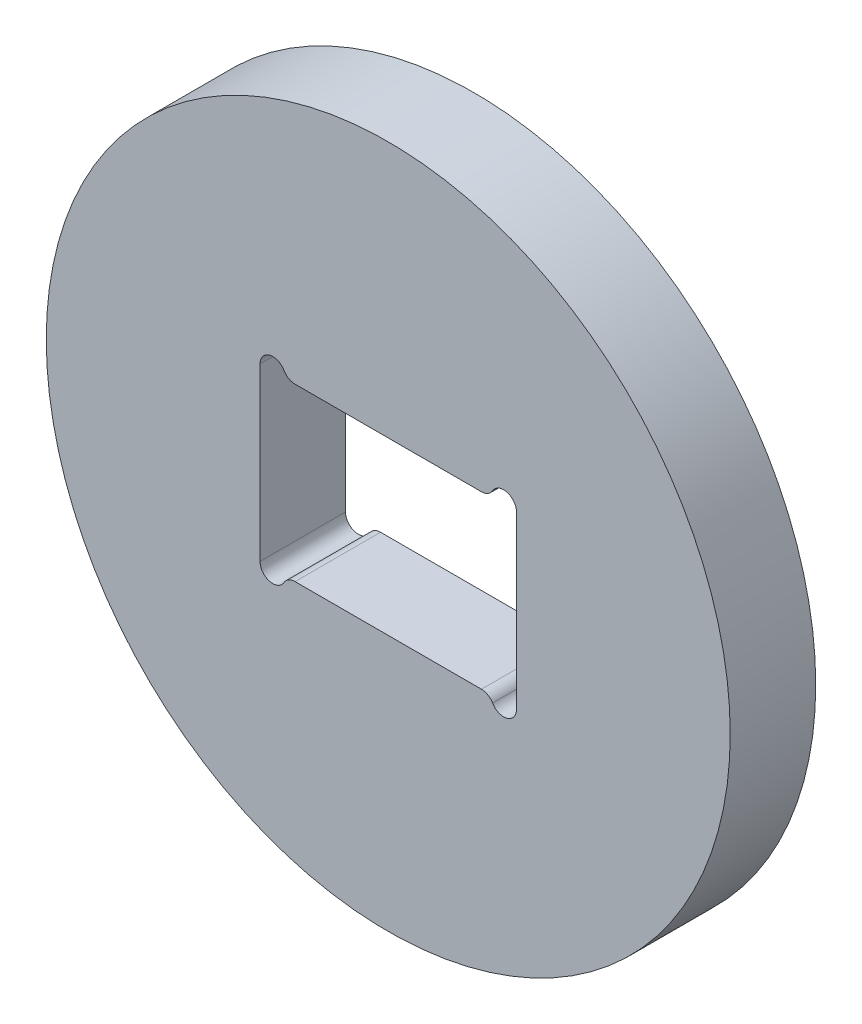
ISO-10303-21;
HEADER;
FILE_DESCRIPTION(('STEP AP214'),'2;1');
FILE_NAME('part.step','',(''),(''),'','','');
FILE_SCHEMA(('AUTOMOTIVE_DESIGN { 1 0 10303 214 1 1 1 1 }'));
ENDSEC;
DATA;
#1=APPLICATION_CONTEXT('core data for automotive mechanical design processes');
#2=APPLICATION_PROTOCOL_DEFINITION('international standard','automotive_design',2000,#1);
#3=PRODUCT_CONTEXT('',#1,'mechanical');
#4=PRODUCT('Part','Part','',(#3));
#5=PRODUCT_RELATED_PRODUCT_CATEGORY('part','',(#4));
#6=PRODUCT_DEFINITION_FORMATION('','',#4);
#7=PRODUCT_DEFINITION_CONTEXT('part definition',#1,'design');
#8=PRODUCT_DEFINITION('design','',#6,#7);
#9=PRODUCT_DEFINITION_SHAPE('','',#8);
#10=(LENGTH_UNIT() NAMED_UNIT(*) SI_UNIT(.MILLI.,.METRE.));
#11=(NAMED_UNIT(*) PLANE_ANGLE_UNIT() SI_UNIT($,.RADIAN.));
#12=(NAMED_UNIT(*) SI_UNIT($,.STERADIAN.) SOLID_ANGLE_UNIT());
#13=UNCERTAINTY_MEASURE_WITH_UNIT(LENGTH_MEASURE(1.E-05),#10,'distance_accuracy_value','');
#14=(GEOMETRIC_REPRESENTATION_CONTEXT(3) GLOBAL_UNCERTAINTY_ASSIGNED_CONTEXT((#13)) GLOBAL_UNIT_ASSIGNED_CONTEXT((#10,
#11,#12)) REPRESENTATION_CONTEXT('',''));
#15=CARTESIAN_POINT('',(0.,0.,0.));
#16=DIRECTION('',(0.,0.,1.));
#17=DIRECTION('',(1.,0.,0.));
#18=AXIS2_PLACEMENT_3D('',#15,#16,#17);
#19=CARTESIAN_POINT('',(0.,0.,10.));
#20=DIRECTION('',(0.,0.,1.));
#21=DIRECTION('',(1.,0.,0.));
#22=AXIS2_PLACEMENT_3D('',#19,#20,#21);
#23=PLANE('',#22);
#24=CARTESIAN_POINT('',(0.,0.,10.));
#25=DIRECTION('',(0.,0.,1.));
#26=DIRECTION('',(1.,0.,0.));
#27=AXIS2_PLACEMENT_3D('',#24,#25,#26);
#28=CIRCLE('',#27,40.);
#29=CARTESIAN_POINT('',(40.,0.,10.));
#30=VERTEX_POINT('',#29);
#31=EDGE_CURVE('E11',#30,#30,#28,.T.);
#32=ORIENTED_EDGE('',*,*,#31,.T.);
#33=EDGE_LOOP('',(#32));
#34=FACE_BOUND('',#33,.T.);
#35=DIRECTION('',(0.,-1.,0.));
#36=VECTOR('',#35,1.);
#37=CARTESIAN_POINT('',(-15.,-10.0000000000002,10.));
#38=LINE('',#37,#36);
#39=CARTESIAN_POINT('',(-15.,10.,10.));
#40=VERTEX_POINT('',#39);
#41=CARTESIAN_POINT('',(-15.,-10.0000000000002,10.));
#42=VERTEX_POINT('',#41);
#43=EDGE_CURVE('E144',#40,#42,#38,.T.);
#44=ORIENTED_EDGE('',*,*,#43,.F.);
#45=CARTESIAN_POINT('',(-13.5,10.,10.));
#46=DIRECTION('',(0.,0.,1.));
#47=DIRECTION('',(1.,0.,0.));
#48=AXIS2_PLACEMENT_3D('',#45,#46,#47);
#49=CIRCLE('',#48,1.5);
#50=CARTESIAN_POINT('',(-12.2009618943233,10.75,10.));
#51=VERTEX_POINT('',#50);
#52=EDGE_CURVE('E135',#51,#40,#49,.T.);
#53=ORIENTED_EDGE('',*,*,#52,.F.);
#54=CARTESIAN_POINT('',(-10.9019237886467,11.5,10.));
#55=DIRECTION('',(0.,0.,-1.));
#56=DIRECTION('',(1.,0.,0.));
#57=AXIS2_PLACEMENT_3D('',#54,#55,#56);
#58=CIRCLE('',#57,1.5);
#59=CARTESIAN_POINT('',(-10.9019237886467,10.,10.));
#60=VERTEX_POINT('',#59);
#61=EDGE_CURVE('E187',#60,#51,#58,.T.);
#62=ORIENTED_EDGE('',*,*,#61,.F.);
#63=DIRECTION('',(-1.,0.,0.));
#64=VECTOR('',#63,1.);
#65=CARTESIAN_POINT('',(-10.9019237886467,10.,10.));
#66=LINE('',#65,#64);
#67=CARTESIAN_POINT('',(10.9019237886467,10.,10.));
#68=VERTEX_POINT('',#67);
#69=EDGE_CURVE('E184',#68,#60,#66,.T.);
#70=ORIENTED_EDGE('',*,*,#69,.F.);
#71=CARTESIAN_POINT('',(10.9019237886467,11.5,10.));
#72=DIRECTION('',(0.,0.,-1.));
#73=DIRECTION('',(1.,0.,0.));
#74=AXIS2_PLACEMENT_3D('',#71,#72,#73);
#75=CIRCLE('',#74,1.5);
#76=CARTESIAN_POINT('',(12.2009618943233,10.75,10.));
#77=VERTEX_POINT('',#76);
#78=EDGE_CURVE('E181',#77,#68,#75,.T.);
#79=ORIENTED_EDGE('',*,*,#78,.F.);
#80=CARTESIAN_POINT('',(13.5,10.,10.));
#81=DIRECTION('',(0.,0.,1.));
#82=DIRECTION('',(1.,0.,0.));
#83=AXIS2_PLACEMENT_3D('',#80,#81,#82);
#84=CIRCLE('',#83,1.5);
#85=CARTESIAN_POINT('',(15.,10.,10.));
#86=VERTEX_POINT('',#85);
#87=EDGE_CURVE('E178',#86,#77,#84,.T.);
#88=ORIENTED_EDGE('',*,*,#87,.F.);
#89=DIRECTION('',(0.,1.,0.));
#90=VECTOR('',#89,1.);
#91=CARTESIAN_POINT('',(15.,10.,10.));
#92=LINE('',#91,#90);
#93=CARTESIAN_POINT('',(15.,-10.0000000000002,10.));
#94=VERTEX_POINT('',#93);
#95=EDGE_CURVE('E175',#94,#86,#92,.T.);
#96=ORIENTED_EDGE('',*,*,#95,.F.);
#97=CARTESIAN_POINT('',(13.5,-10.0000000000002,10.));
#98=DIRECTION('',(0.,0.,1.));
#99=DIRECTION('',(1.,0.,0.));
#100=AXIS2_PLACEMENT_3D('',#97,#98,#99);
#101=CIRCLE('',#100,1.5);
#102=CARTESIAN_POINT('',(12.2009618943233,-10.7500000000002,10.));
#103=VERTEX_POINT('',#102);
#104=EDGE_CURVE('E172',#103,#94,#101,.T.);
#105=ORIENTED_EDGE('',*,*,#104,.F.);
#106=CARTESIAN_POINT('',(10.9019237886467,-11.5000000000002,10.));
#107=DIRECTION('',(0.,0.,-1.));
#108=DIRECTION('',(1.,0.,0.));
#109=AXIS2_PLACEMENT_3D('',#106,#107,#108);
#110=CIRCLE('',#109,1.5);
#111=CARTESIAN_POINT('',(10.9019237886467,-10.0000000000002,10.));
#112=VERTEX_POINT('',#111);
#113=EDGE_CURVE('E169',#112,#103,#110,.T.);
#114=ORIENTED_EDGE('',*,*,#113,.F.);
#115=DIRECTION('',(1.,0.,0.));
#116=VECTOR('',#115,1.);
#117=CARTESIAN_POINT('',(10.9019237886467,-10.0000000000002,10.));
#118=LINE('',#117,#116);
#119=CARTESIAN_POINT('',(-10.9019237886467,-10.0000000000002,10.));
#120=VERTEX_POINT('',#119);
#121=EDGE_CURVE('E166',#120,#112,#118,.T.);
#122=ORIENTED_EDGE('',*,*,#121,.F.);
#123=CARTESIAN_POINT('',(-10.9019237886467,-11.5000000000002,10.));
#124=DIRECTION('',(0.,0.,-1.));
#125=DIRECTION('',(1.,0.,0.));
#126=AXIS2_PLACEMENT_3D('',#123,#124,#125);
#127=CIRCLE('',#126,1.5);
#128=CARTESIAN_POINT('',(-12.2009618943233,-10.7500000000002,10.));
#129=VERTEX_POINT('',#128);
#130=EDGE_CURVE('E161',#129,#120,#127,.T.);
#131=ORIENTED_EDGE('',*,*,#130,.F.);
#132=CARTESIAN_POINT('',(-13.5,-10.0000000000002,10.));
#133=DIRECTION('',(0.,0.,1.));
#134=DIRECTION('',(1.,0.,0.));
#135=AXIS2_PLACEMENT_3D('',#132,#133,#134);
#136=CIRCLE('',#135,1.5);
#137=EDGE_CURVE('E157',#42,#129,#136,.T.);
#138=ORIENTED_EDGE('',*,*,#137,.F.);
#139=EDGE_LOOP('',(#44,#53,#62,#70,#79,#88,#96,#105,#114,#122,#131,#138));
#140=FACE_BOUND('',#139,.T.);
#141=ADVANCED_FACE('F45',(#34,#140),#23,.T.);
#142=CARTESIAN_POINT('',(0.,0.,0.));
#143=DIRECTION('',(0.,0.,1.));
#144=DIRECTION('',(1.,0.,0.));
#145=AXIS2_PLACEMENT_3D('',#142,#143,#144);
#146=PLANE('',#145);
#147=CARTESIAN_POINT('',(0.,0.,0.));
#148=DIRECTION('',(0.,0.,1.));
#149=DIRECTION('',(1.,0.,0.));
#150=AXIS2_PLACEMENT_3D('',#147,#148,#149);
#151=CIRCLE('',#150,40.);
#152=CARTESIAN_POINT('',(40.,0.,0.));
#153=VERTEX_POINT('',#152);
#154=EDGE_CURVE('E49',#153,#153,#151,.T.);
#155=ORIENTED_EDGE('',*,*,#154,.F.);
#156=EDGE_LOOP('',(#155));
#157=FACE_BOUND('',#156,.T.);
#158=CARTESIAN_POINT('',(-13.5,10.,0.));
#159=DIRECTION('',(0.,0.,1.));
#160=DIRECTION('',(1.,0.,0.));
#161=AXIS2_PLACEMENT_3D('',#158,#159,#160);
#162=CIRCLE('',#161,1.5);
#163=CARTESIAN_POINT('',(-12.2009618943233,10.75,0.));
#164=VERTEX_POINT('',#163);
#165=CARTESIAN_POINT('',(-15.,10.,0.));
#166=VERTEX_POINT('',#165);
#167=EDGE_CURVE('E69',#164,#166,#162,.T.);
#168=ORIENTED_EDGE('',*,*,#167,.T.);
#169=DIRECTION('',(0.,-1.,0.));
#170=VECTOR('',#169,1.);
#171=CARTESIAN_POINT('',(-15.,-10.0000000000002,0.));
#172=LINE('',#171,#170);
#173=CARTESIAN_POINT('',(-15.,-10.0000000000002,0.));
#174=VERTEX_POINT('',#173);
#175=EDGE_CURVE('E151',#166,#174,#172,.T.);
#176=ORIENTED_EDGE('',*,*,#175,.T.);
#177=CARTESIAN_POINT('',(-13.5,-10.0000000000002,0.));
#178=DIRECTION('',(0.,0.,1.));
#179=DIRECTION('',(1.,0.,0.));
#180=AXIS2_PLACEMENT_3D('',#177,#178,#179);
#181=CIRCLE('',#180,1.5);
#182=CARTESIAN_POINT('',(-12.2009618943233,-10.7500000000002,0.));
#183=VERTEX_POINT('',#182);
#184=EDGE_CURVE('E194',#174,#183,#181,.T.);
#185=ORIENTED_EDGE('',*,*,#184,.T.);
#186=CARTESIAN_POINT('',(-10.9019237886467,-11.5000000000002,0.));
#187=DIRECTION('',(0.,0.,-1.));
#188=DIRECTION('',(1.,0.,0.));
#189=AXIS2_PLACEMENT_3D('',#186,#187,#188);
#190=CIRCLE('',#189,1.5);
#191=CARTESIAN_POINT('',(-10.9019237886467,-10.0000000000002,0.));
#192=VERTEX_POINT('',#191);
#193=EDGE_CURVE('E198',#183,#192,#190,.T.);
#194=ORIENTED_EDGE('',*,*,#193,.T.);
#195=DIRECTION('',(1.,0.,0.));
#196=VECTOR('',#195,1.);
#197=CARTESIAN_POINT('',(10.9019237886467,-10.0000000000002,0.));
#198=LINE('',#197,#196);
#199=CARTESIAN_POINT('',(10.9019237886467,-10.0000000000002,0.));
#200=VERTEX_POINT('',#199);
#201=EDGE_CURVE('E202',#192,#200,#198,.T.);
#202=ORIENTED_EDGE('',*,*,#201,.T.);
#203=CARTESIAN_POINT('',(10.9019237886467,-11.5000000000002,0.));
#204=DIRECTION('',(0.,0.,-1.));
#205=DIRECTION('',(1.,0.,0.));
#206=AXIS2_PLACEMENT_3D('',#203,#204,#205);
#207=CIRCLE('',#206,1.5);
#208=CARTESIAN_POINT('',(12.2009618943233,-10.7500000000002,0.));
#209=VERTEX_POINT('',#208);
#210=EDGE_CURVE('E206',#200,#209,#207,.T.);
#211=ORIENTED_EDGE('',*,*,#210,.T.);
#212=CARTESIAN_POINT('',(13.5,-10.0000000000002,0.));
#213=DIRECTION('',(0.,0.,1.));
#214=DIRECTION('',(1.,0.,0.));
#215=AXIS2_PLACEMENT_3D('',#212,#213,#214);
#216=CIRCLE('',#215,1.5);
#217=CARTESIAN_POINT('',(15.,-10.0000000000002,0.));
#218=VERTEX_POINT('',#217);
#219=EDGE_CURVE('E210',#209,#218,#216,.T.);
#220=ORIENTED_EDGE('',*,*,#219,.T.);
#221=DIRECTION('',(0.,1.,0.));
#222=VECTOR('',#221,1.);
#223=CARTESIAN_POINT('',(15.,10.,0.));
#224=LINE('',#223,#222);
#225=CARTESIAN_POINT('',(15.,10.,0.));
#226=VERTEX_POINT('',#225);
#227=EDGE_CURVE('E214',#218,#226,#224,.T.);
#228=ORIENTED_EDGE('',*,*,#227,.T.);
#229=CARTESIAN_POINT('',(13.5,10.,0.));
#230=DIRECTION('',(0.,0.,1.));
#231=DIRECTION('',(1.,0.,0.));
#232=AXIS2_PLACEMENT_3D('',#229,#230,#231);
#233=CIRCLE('',#232,1.5);
#234=CARTESIAN_POINT('',(12.2009618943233,10.75,0.));
#235=VERTEX_POINT('',#234);
#236=EDGE_CURVE('E218',#226,#235,#233,.T.);
#237=ORIENTED_EDGE('',*,*,#236,.T.);
#238=CARTESIAN_POINT('',(10.9019237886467,11.5,0.));
#239=DIRECTION('',(0.,0.,-1.));
#240=DIRECTION('',(1.,0.,0.));
#241=AXIS2_PLACEMENT_3D('',#238,#239,#240);
#242=CIRCLE('',#241,1.5);
#243=CARTESIAN_POINT('',(10.9019237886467,10.,0.));
#244=VERTEX_POINT('',#243);
#245=EDGE_CURVE('E222',#235,#244,#242,.T.);
#246=ORIENTED_EDGE('',*,*,#245,.T.);
#247=DIRECTION('',(-1.,0.,0.));
#248=VECTOR('',#247,1.);
#249=CARTESIAN_POINT('',(-10.9019237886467,10.,0.));
#250=LINE('',#249,#248);
#251=CARTESIAN_POINT('',(-10.9019237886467,10.,0.));
#252=VERTEX_POINT('',#251);
#253=EDGE_CURVE('E226',#244,#252,#250,.T.);
#254=ORIENTED_EDGE('',*,*,#253,.T.);
#255=CARTESIAN_POINT('',(-10.9019237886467,11.5,0.));
#256=DIRECTION('',(0.,0.,-1.));
#257=DIRECTION('',(1.,0.,0.));
#258=AXIS2_PLACEMENT_3D('',#255,#256,#257);
#259=CIRCLE('',#258,1.5);
#260=EDGE_CURVE('E145',#252,#164,#259,.T.);
#261=ORIENTED_EDGE('',*,*,#260,.T.);
#262=EDGE_LOOP('',(#168,#176,#185,#194,#202,#211,#220,#228,#237,#246,#254,#261));
#263=FACE_BOUND('',#262,.T.);
#264=ADVANCED_FACE('F268',(#157,#263),#146,.F.);
#265=CARTESIAN_POINT('',(0.,0.,10.));
#266=DIRECTION('',(0.,0.,-1.));
#267=DIRECTION('',(-1.,0.,0.));
#268=AXIS2_PLACEMENT_3D('',#265,#266,#267);
#269=CYLINDRICAL_SURFACE('',#268,40.);
#270=ORIENTED_EDGE('',*,*,#31,.F.);
#271=EDGE_LOOP('',(#270));
#272=FACE_BOUND('',#271,.T.);
#273=ORIENTED_EDGE('',*,*,#154,.T.);
#274=EDGE_LOOP('',(#273));
#275=FACE_BOUND('',#274,.T.);
#276=ADVANCED_FACE('F47',(#272,#275),#269,.T.);
#277=CARTESIAN_POINT('',(-13.5,10.,10.));
#278=DIRECTION('',(0.,0.,-1.));
#279=DIRECTION('',(-1.,0.,0.));
#280=AXIS2_PLACEMENT_3D('',#277,#278,#279);
#281=CYLINDRICAL_SURFACE('',#280,1.5);
#282=ORIENTED_EDGE('',*,*,#167,.F.);
#283=DIRECTION('',(0.,0.,-1.));
#284=VECTOR('',#283,1.);
#285=CARTESIAN_POINT('',(-12.2009618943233,10.75,10.));
#286=LINE('',#285,#284);
#287=EDGE_CURVE('E139',#51,#164,#286,.T.);
#288=ORIENTED_EDGE('',*,*,#287,.F.);
#289=ORIENTED_EDGE('',*,*,#52,.T.);
#290=DIRECTION('',(0.,0.,-1.));
#291=VECTOR('',#290,1.);
#292=CARTESIAN_POINT('',(-15.,10.,10.));
#293=LINE('',#292,#291);
#294=EDGE_CURVE('E138',#40,#166,#293,.T.);
#295=ORIENTED_EDGE('',*,*,#294,.T.);
#296=EDGE_LOOP('',(#282,#288,#289,#295));
#297=FACE_BOUND('',#296,.T.);
#298=ADVANCED_FACE('F137',(#297),#281,.F.);
#299=CARTESIAN_POINT('',(-15.,-10.0000000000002,10.));
#300=DIRECTION('',(1.,0.,0.));
#301=DIRECTION('',(0.,0.,-1.));
#302=AXIS2_PLACEMENT_3D('',#299,#300,#301);
#303=PLANE('',#302);
#304=ORIENTED_EDGE('',*,*,#175,.F.);
#305=ORIENTED_EDGE('',*,*,#294,.F.);
#306=ORIENTED_EDGE('',*,*,#43,.T.);
#307=DIRECTION('',(0.,0.,-1.));
#308=VECTOR('',#307,1.);
#309=CARTESIAN_POINT('',(-15.,-10.0000000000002,10.));
#310=LINE('',#309,#308);
#311=EDGE_CURVE('E153',#42,#174,#310,.T.);
#312=ORIENTED_EDGE('',*,*,#311,.T.);
#313=EDGE_LOOP('',(#304,#305,#306,#312));
#314=FACE_BOUND('',#313,.T.);
#315=ADVANCED_FACE('F148',(#314),#303,.T.);
#316=CARTESIAN_POINT('',(-13.5,-10.0000000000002,10.));
#317=DIRECTION('',(0.,0.,-1.));
#318=DIRECTION('',(-1.,0.,0.));
#319=AXIS2_PLACEMENT_3D('',#316,#317,#318);
#320=CYLINDRICAL_SURFACE('',#319,1.5);
#321=ORIENTED_EDGE('',*,*,#184,.F.);
#322=ORIENTED_EDGE('',*,*,#311,.F.);
#323=ORIENTED_EDGE('',*,*,#137,.T.);
#324=DIRECTION('',(0.,0.,-1.));
#325=VECTOR('',#324,1.);
#326=CARTESIAN_POINT('',(-12.2009618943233,-10.7500000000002,10.));
#327=LINE('',#326,#325);
#328=EDGE_CURVE('E258',#129,#183,#327,.T.);
#329=ORIENTED_EDGE('',*,*,#328,.T.);
#330=EDGE_LOOP('',(#321,#322,#323,#329));
#331=FACE_BOUND('',#330,.T.);
#332=ADVANCED_FACE('F264',(#331),#320,.F.);
#333=CARTESIAN_POINT('',(-10.9019237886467,-11.5000000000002,10.));
#334=DIRECTION('',(0.,0.,-1.));
#335=DIRECTION('',(-1.,0.,0.));
#336=AXIS2_PLACEMENT_3D('',#333,#334,#335);
#337=CYLINDRICAL_SURFACE('',#336,1.5);
#338=ORIENTED_EDGE('',*,*,#193,.F.);
#339=ORIENTED_EDGE('',*,*,#328,.F.);
#340=ORIENTED_EDGE('',*,*,#130,.T.);
#341=DIRECTION('',(0.,0.,-1.));
#342=VECTOR('',#341,1.);
#343=CARTESIAN_POINT('',(-10.9019237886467,-10.0000000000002,10.));
#344=LINE('',#343,#342);
#345=EDGE_CURVE('E255',#120,#192,#344,.T.);
#346=ORIENTED_EDGE('',*,*,#345,.T.);
#347=EDGE_LOOP('',(#338,#339,#340,#346));
#348=FACE_BOUND('',#347,.T.);
#349=ADVANCED_FACE('F306',(#348),#337,.T.);
#350=CARTESIAN_POINT('',(10.9019237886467,-10.0000000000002,10.));
#351=DIRECTION('',(0.,1.,0.));
#352=DIRECTION('',(-1.,0.,0.));
#353=AXIS2_PLACEMENT_3D('',#350,#351,#352);
#354=PLANE('',#353);
#355=ORIENTED_EDGE('',*,*,#201,.F.);
#356=ORIENTED_EDGE('',*,*,#345,.F.);
#357=ORIENTED_EDGE('',*,*,#121,.T.);
#358=DIRECTION('',(0.,0.,-1.));
#359=VECTOR('',#358,1.);
#360=CARTESIAN_POINT('',(10.9019237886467,-10.0000000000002,10.));
#361=LINE('',#360,#359);
#362=EDGE_CURVE('E252',#112,#200,#361,.T.);
#363=ORIENTED_EDGE('',*,*,#362,.T.);
#364=EDGE_LOOP('',(#355,#356,#357,#363));
#365=FACE_BOUND('',#364,.T.);
#366=ADVANCED_FACE('F304',(#365),#354,.T.);
#367=CARTESIAN_POINT('',(10.9019237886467,-11.5000000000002,10.));
#368=DIRECTION('',(0.,0.,-1.));
#369=DIRECTION('',(-1.,0.,0.));
#370=AXIS2_PLACEMENT_3D('',#367,#368,#369);
#371=CYLINDRICAL_SURFACE('',#370,1.5);
#372=ORIENTED_EDGE('',*,*,#210,.F.);
#373=ORIENTED_EDGE('',*,*,#362,.F.);
#374=ORIENTED_EDGE('',*,*,#113,.T.);
#375=DIRECTION('',(0.,0.,-1.));
#376=VECTOR('',#375,1.);
#377=CARTESIAN_POINT('',(12.2009618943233,-10.7500000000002,10.));
#378=LINE('',#377,#376);
#379=EDGE_CURVE('E249',#103,#209,#378,.T.);
#380=ORIENTED_EDGE('',*,*,#379,.T.);
#381=EDGE_LOOP('',(#372,#373,#374,#380));
#382=FACE_BOUND('',#381,.T.);
#383=ADVANCED_FACE('F298',(#382),#371,.T.);
#384=CARTESIAN_POINT('',(13.5,-10.0000000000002,10.));
#385=DIRECTION('',(0.,0.,-1.));
#386=DIRECTION('',(-1.,0.,0.));
#387=AXIS2_PLACEMENT_3D('',#384,#385,#386);
#388=CYLINDRICAL_SURFACE('',#387,1.5);
#389=ORIENTED_EDGE('',*,*,#219,.F.);
#390=ORIENTED_EDGE('',*,*,#379,.F.);
#391=ORIENTED_EDGE('',*,*,#104,.T.);
#392=DIRECTION('',(0.,0.,-1.));
#393=VECTOR('',#392,1.);
#394=CARTESIAN_POINT('',(15.,-10.0000000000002,10.));
#395=LINE('',#394,#393);
#396=EDGE_CURVE('E246',#94,#218,#395,.T.);
#397=ORIENTED_EDGE('',*,*,#396,.T.);
#398=EDGE_LOOP('',(#389,#390,#391,#397));
#399=FACE_BOUND('',#398,.T.);
#400=ADVANCED_FACE('F294',(#399),#388,.F.);
#401=CARTESIAN_POINT('',(15.,10.,10.));
#402=DIRECTION('',(-1.,0.,0.));
#403=DIRECTION('',(0.,-1.,0.));
#404=AXIS2_PLACEMENT_3D('',#401,#402,#403);
#405=PLANE('',#404);
#406=ORIENTED_EDGE('',*,*,#227,.F.);
#407=ORIENTED_EDGE('',*,*,#396,.F.);
#408=ORIENTED_EDGE('',*,*,#95,.T.);
#409=DIRECTION('',(0.,0.,-1.));
#410=VECTOR('',#409,1.);
#411=CARTESIAN_POINT('',(15.,10.,10.));
#412=LINE('',#411,#410);
#413=EDGE_CURVE('E243',#86,#226,#412,.T.);
#414=ORIENTED_EDGE('',*,*,#413,.T.);
#415=EDGE_LOOP('',(#406,#407,#408,#414));
#416=FACE_BOUND('',#415,.T.);
#417=ADVANCED_FACE('F291',(#416),#405,.T.);
#418=CARTESIAN_POINT('',(13.5,10.,10.));
#419=DIRECTION('',(0.,0.,-1.));
#420=DIRECTION('',(-1.,0.,0.));
#421=AXIS2_PLACEMENT_3D('',#418,#419,#420);
#422=CYLINDRICAL_SURFACE('',#421,1.5);
#423=ORIENTED_EDGE('',*,*,#236,.F.);
#424=ORIENTED_EDGE('',*,*,#413,.F.);
#425=ORIENTED_EDGE('',*,*,#87,.T.);
#426=DIRECTION('',(0.,0.,-1.));
#427=VECTOR('',#426,1.);
#428=CARTESIAN_POINT('',(12.2009618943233,10.75,10.));
#429=LINE('',#428,#427);
#430=EDGE_CURVE('E240',#77,#235,#429,.T.);
#431=ORIENTED_EDGE('',*,*,#430,.T.);
#432=EDGE_LOOP('',(#423,#424,#425,#431));
#433=FACE_BOUND('',#432,.T.);
#434=ADVANCED_FACE('F283',(#433),#422,.F.);
#435=CARTESIAN_POINT('',(10.9019237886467,11.5,10.));
#436=DIRECTION('',(0.,0.,-1.));
#437=DIRECTION('',(-1.,0.,0.));
#438=AXIS2_PLACEMENT_3D('',#435,#436,#437);
#439=CYLINDRICAL_SURFACE('',#438,1.5);
#440=ORIENTED_EDGE('',*,*,#245,.F.);
#441=ORIENTED_EDGE('',*,*,#430,.F.);
#442=ORIENTED_EDGE('',*,*,#78,.T.);
#443=DIRECTION('',(0.,0.,-1.));
#444=VECTOR('',#443,1.);
#445=CARTESIAN_POINT('',(10.9019237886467,10.,10.));
#446=LINE('',#445,#444);
#447=EDGE_CURVE('E237',#68,#244,#446,.T.);
#448=ORIENTED_EDGE('',*,*,#447,.T.);
#449=EDGE_LOOP('',(#440,#441,#442,#448));
#450=FACE_BOUND('',#449,.T.);
#451=ADVANCED_FACE('F279',(#450),#439,.T.);
#452=CARTESIAN_POINT('',(-10.9019237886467,10.,10.));
#453=DIRECTION('',(0.,-1.,0.));
#454=DIRECTION('',(1.,0.,0.));
#455=AXIS2_PLACEMENT_3D('',#452,#453,#454);
#456=PLANE('',#455);
#457=ORIENTED_EDGE('',*,*,#253,.F.);
#458=ORIENTED_EDGE('',*,*,#447,.F.);
#459=ORIENTED_EDGE('',*,*,#69,.T.);
#460=DIRECTION('',(0.,0.,-1.));
#461=VECTOR('',#460,1.);
#462=CARTESIAN_POINT('',(-10.9019237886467,10.,10.));
#463=LINE('',#462,#461);
#464=EDGE_CURVE('E61',#60,#252,#463,.T.);
#465=ORIENTED_EDGE('',*,*,#464,.T.);
#466=EDGE_LOOP('',(#457,#458,#459,#465));
#467=FACE_BOUND('',#466,.T.);
#468=ADVANCED_FACE('F276',(#467),#456,.T.);
#469=CARTESIAN_POINT('',(-10.9019237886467,11.5,10.));
#470=DIRECTION('',(0.,0.,-1.));
#471=DIRECTION('',(-1.,0.,0.));
#472=AXIS2_PLACEMENT_3D('',#469,#470,#471);
#473=CYLINDRICAL_SURFACE('',#472,1.5);
#474=ORIENTED_EDGE('',*,*,#260,.F.);
#475=ORIENTED_EDGE('',*,*,#464,.F.);
#476=ORIENTED_EDGE('',*,*,#61,.T.);
#477=ORIENTED_EDGE('',*,*,#287,.T.);
#478=EDGE_LOOP('',(#474,#475,#476,#477));
#479=FACE_BOUND('',#478,.T.);
#480=ADVANCED_FACE('F270',(#479),#473,.T.);
#481=CLOSED_SHELL('',(#141,#264,#276,#298,#315,#332,#349,#366,#383,#400,#417,#434,#451,#468,#480));
#482=MANIFOLD_SOLID_BREP('B2',#481);
#483=ADVANCED_BREP_SHAPE_REPRESENTATION('',(#18,#482),#14);
#484=SHAPE_DEFINITION_REPRESENTATION(#9,#483);
ENDSEC;
END-ISO-10303-21;
